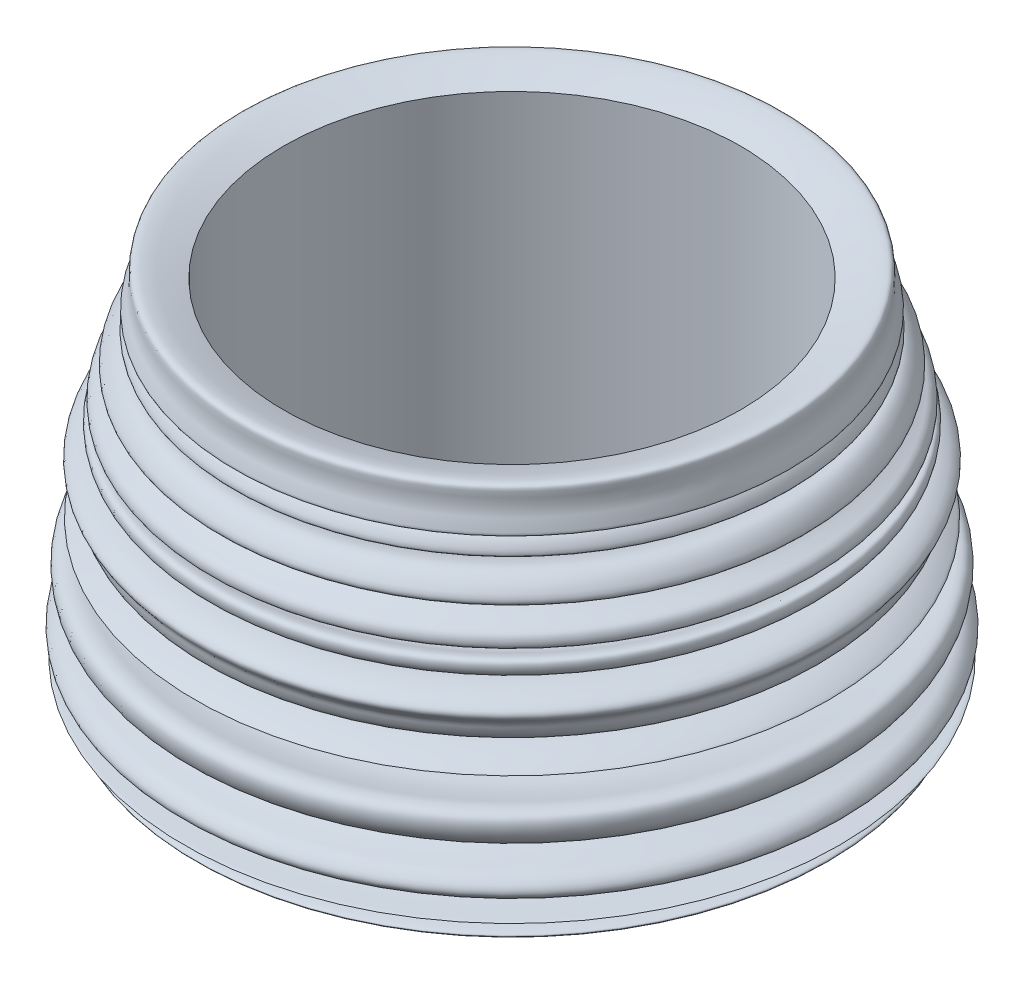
ISO-10303-21;
HEADER;
FILE_DESCRIPTION(('STEP AP214'),'2;1');
FILE_NAME('part.step','',(''),(''),'','','');
FILE_SCHEMA(('AUTOMOTIVE_DESIGN { 1 0 10303 214 1 1 1 1 }'));
ENDSEC;
DATA;
#1=APPLICATION_CONTEXT('core data for automotive mechanical design processes');
#2=APPLICATION_PROTOCOL_DEFINITION('international standard','automotive_design',2000,#1);
#3=PRODUCT_CONTEXT('',#1,'mechanical');
#4=PRODUCT('Part','Part','',(#3));
#5=PRODUCT_RELATED_PRODUCT_CATEGORY('part','',(#4));
#6=PRODUCT_DEFINITION_FORMATION('','',#4);
#7=PRODUCT_DEFINITION_CONTEXT('part definition',#1,'design');
#8=PRODUCT_DEFINITION('design','',#6,#7);
#9=PRODUCT_DEFINITION_SHAPE('','',#8);
#10=(LENGTH_UNIT() NAMED_UNIT(*) SI_UNIT(.MILLI.,.METRE.));
#11=(NAMED_UNIT(*) PLANE_ANGLE_UNIT() SI_UNIT($,.RADIAN.));
#12=(NAMED_UNIT(*) SI_UNIT($,.STERADIAN.) SOLID_ANGLE_UNIT());
#13=UNCERTAINTY_MEASURE_WITH_UNIT(LENGTH_MEASURE(1.E-05),#10,'distance_accuracy_value','');
#14=(GEOMETRIC_REPRESENTATION_CONTEXT(3) GLOBAL_UNCERTAINTY_ASSIGNED_CONTEXT((#13)) GLOBAL_UNIT_ASSIGNED_CONTEXT((#10,
#11,#12)) REPRESENTATION_CONTEXT('',''));
#15=CARTESIAN_POINT('',(0.,0.,0.));
#16=DIRECTION('',(0.,0.,1.));
#17=DIRECTION('',(1.,0.,0.));
#18=AXIS2_PLACEMENT_3D('',#15,#16,#17);
#19=CARTESIAN_POINT('',(254.,-203.2,0.));
#20=CARTESIAN_POINT('',(265.952529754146,-204.882481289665,0.));
#21=CARTESIAN_POINT('',(286.664606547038,-186.560116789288,0.));
#22=CARTESIAN_POINT('',(314.196289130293,-198.948779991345,0.));
#23=CARTESIAN_POINT('',(375.371053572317,-177.420666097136,0.));
#24=CARTESIAN_POINT('',(292.862010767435,-179.289172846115,0.));
#25=CARTESIAN_POINT('',(395.026881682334,-155.575786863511,0.));
#26=CARTESIAN_POINT('',(330.12286532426,-162.501229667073,0.));
#27=CARTESIAN_POINT('',(303.825414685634,-146.242672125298,0.));
#28=CARTESIAN_POINT('',(254.298366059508,-201.355487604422,0.));
#29=CARTESIAN_POINT('',(283.168759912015,-138.834023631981,0.));
#30=CARTESIAN_POINT('',(318.663391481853,-125.09657352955,0.));
#31=CARTESIAN_POINT('',(344.801872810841,-150.254129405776,0.));
#32=CARTESIAN_POINT('',(371.552736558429,-132.21928150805,0.));
#33=CARTESIAN_POINT('',(357.331031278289,-116.852774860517,0.));
#34=CARTESIAN_POINT('',(335.183473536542,-116.626494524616,0.));
#35=CARTESIAN_POINT('',(314.76371224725,-104.114267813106,0.));
#36=CARTESIAN_POINT('',(290.930141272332,-105.867373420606,0.));
#37=CARTESIAN_POINT('',(265.138896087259,-84.6601366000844,0.));
#38=CARTESIAN_POINT('',(296.700396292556,-79.2419504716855,0.));
#39=CARTESIAN_POINT('',(315.056688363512,-84.3141200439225,0.));
#40=CARTESIAN_POINT('',(333.018862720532,-85.1391881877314,0.));
#41=CARTESIAN_POINT('',(353.168796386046,-96.6513522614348,0.));
#42=CARTESIAN_POINT('',(364.360359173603,-77.9605645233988,0.));
#43=CARTESIAN_POINT('',(359.937371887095,-54.0381315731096,0.));
#44=CARTESIAN_POINT('',(334.350198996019,-62.0993563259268,0.));
#45=CARTESIAN_POINT('',(308.408866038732,-65.5578838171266,0.));
#46=CARTESIAN_POINT('',(266.921298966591,-65.152725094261,0.));
#47=CARTESIAN_POINT('',(278.116361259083,-25.289691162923,0.));
#48=CARTESIAN_POINT('',(300.203835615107,-30.0914391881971,0.));
#49=CARTESIAN_POINT('',(319.013552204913,-27.112533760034,0.));
#50=CARTESIAN_POINT('',(323.597307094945,-42.6009982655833,0.));
#51=CARTESIAN_POINT('',(345.705780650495,-34.7645053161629,0.));
#52=CARTESIAN_POINT('',(323.942552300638,-18.5220381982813,0.));
#53=CARTESIAN_POINT('',(371.866688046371,-35.6175920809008,0.));
#54=CARTESIAN_POINT('',(310.700893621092,-4.70586404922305,0.));
#55=CARTESIAN_POINT('',(293.182882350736,-25.2178642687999,0.));
#56=CARTESIAN_POINT('',(263.65787070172,-11.8919799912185,0.));
#57=CARTESIAN_POINT('',(272.759148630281,8.94482974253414,0.));
#58=CARTESIAN_POINT('',(286.787394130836,-5.3234872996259,0.));
#59=CARTESIAN_POINT('',(304.508520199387,-2.0808679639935,0.));
#60=CARTESIAN_POINT('',(321.599752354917,8.0992976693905,0.));
#61=CARTESIAN_POINT('',(338.504374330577,-5.47746777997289,0.));
#62=CARTESIAN_POINT('',(344.332027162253,9.37396273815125,0.));
#63=CARTESIAN_POINT('',(344.464675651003,19.2276328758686,0.));
#64=CARTESIAN_POINT('',(371.02466060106,41.4546052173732,0.));
#65=CARTESIAN_POINT('',(283.406826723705,53.9142230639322,0.));
#66=CARTESIAN_POINT('',(288.090688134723,13.3639981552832,0.));
#67=CARTESIAN_POINT('',(257.5613643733,28.4503665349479,0.));
#68=CARTESIAN_POINT('',(272.988727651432,49.2485078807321,0.));
#69=CARTESIAN_POINT('',(294.842139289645,57.6942232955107,0.));
#70=CARTESIAN_POINT('',(315.591317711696,51.4499757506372,0.));
#71=CARTESIAN_POINT('',(337.347308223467,55.5345952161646,0.));
#72=CARTESIAN_POINT('',(337.440008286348,76.2220269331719,0.));
#73=CARTESIAN_POINT('',(311.620096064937,64.270468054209,0.));
#74=CARTESIAN_POINT('',(294.468290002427,71.3067175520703,0.));
#75=CARTESIAN_POINT('',(258.569658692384,53.1430547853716,0.));
#76=CARTESIAN_POINT('',(272.119513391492,85.9415518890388,0.));
#77=CARTESIAN_POINT('',(293.905168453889,84.6174731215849,0.));
#78=CARTESIAN_POINT('',(311.847531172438,83.8549155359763,0.));
#79=CARTESIAN_POINT('',(336.543673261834,76.1888915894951,0.));
#80=CARTESIAN_POINT('',(332.609875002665,97.648509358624,0.));
#81=CARTESIAN_POINT('',(315.390923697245,98.4594451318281,0.));
#82=CARTESIAN_POINT('',(301.457676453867,112.374885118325,0.));
#83=CARTESIAN_POINT('',(281.985278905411,109.240948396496,0.));
#84=CARTESIAN_POINT('',(266.402647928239,85.0141285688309,0.));
#85=CARTESIAN_POINT('',(266.857617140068,121.655788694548,0.));
#86=CARTESIAN_POINT('',(287.740186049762,118.600653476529,0.));
#87=CARTESIAN_POINT('',(303.682688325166,122.96918095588,0.));
#88=CARTESIAN_POINT('',(312.888564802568,111.801079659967,0.));
#89=CARTESIAN_POINT('',(328.451726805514,117.979912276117,0.));
#90=CARTESIAN_POINT('',(317.541079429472,133.78753263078,0.));
#91=CARTESIAN_POINT('',(299.794900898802,146.452207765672,0.));
#92=CARTESIAN_POINT('',(263.029415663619,125.339461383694,0.));
#93=CARTESIAN_POINT('',(266.169354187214,155.511947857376,0.));
#94=CARTESIAN_POINT('',(286.086476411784,155.871857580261,0.));
#95=CARTESIAN_POINT('',(312.781305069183,147.577906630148,0.));
#96=CARTESIAN_POINT('',(299.634134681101,175.105388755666,0.));
#97=CARTESIAN_POINT('',(280.969532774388,172.842765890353,0.));
#98=CARTESIAN_POINT('',(252.556573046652,208.19344865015,0.));
#99=CARTESIAN_POINT('',(319.58357591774,154.571841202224,0.));
#100=CARTESIAN_POINT('',(289.113686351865,209.782839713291,0.));
#101=CARTESIAN_POINT('',(317.868052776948,226.535574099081,0.));
#102=CARTESIAN_POINT('',(254.,203.2,0.));
#103=B_SPLINE_CURVE_WITH_KNOTS('',3,(#19,#20,#21,#22,#23,#24,#25,#26,#27,#28,#29,#30,#31,#32,
#33,#34,#35,#36,#37,#38,#39,#40,#41,#42,#43,#44,#45,#46,#47,#48,#49,#50,#51,#52,#53,#54,#55,#56,
#57,#58,#59,#60,#61,#62,#63,#64,#65,#66,#67,#68,#69,#70,#71,#72,#73,#74,#75,#76,#77,#78,#79,#80,
#81,#82,#83,#84,#85,#86,#87,#88,#89,#90,#91,#92,#93,#94,#95,#96,#97,#98,#99,#100,#101,#102),
.UNSPECIFIED.,.F.,.F.,(4,1,1,1,1,1,1,1,1,1,1,1,1,1,1,1,1,1,1,1,1,1,1,1,1,1,1,1,1,1,1,1,1,1,1,1,
1,1,1,1,1,1,1,1,1,1,1,1,1,1,1,1,1,1,1,1,1,1,1,1,1,1,1,1,1,1,1,1,1,1,1,1,1,1,1,1,1,1,1,1,1,4),
(0.,0.0205009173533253,0.0340249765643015,0.0554400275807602,0.0707353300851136,
0.0947901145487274,0.114249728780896,0.124880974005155,0.150563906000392,0.173100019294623,
0.187899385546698,0.21185747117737,0.219446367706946,0.228676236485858,0.235917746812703,
0.256752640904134,0.264033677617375,0.277220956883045,0.289758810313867,0.297494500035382,
0.311311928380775,0.319299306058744,0.33056579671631,0.337807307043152,0.354113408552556,
0.360954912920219,0.385969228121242,0.396681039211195,0.411193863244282,0.417876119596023,
0.424402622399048,0.432118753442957,0.438092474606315,0.447807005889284,0.467003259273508,
0.483846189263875,0.496773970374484,0.503001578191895,0.508772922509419,0.521694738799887,
0.530605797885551,0.539814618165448,0.546260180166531,0.550665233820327,0.556639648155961,
0.592136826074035,0.597248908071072,0.609324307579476,0.619395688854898,0.63014172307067,
0.64750675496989,0.655191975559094,0.661345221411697,0.671016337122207,0.686708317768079,
0.70019839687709,0.710383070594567,0.723582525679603,0.732245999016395,0.744556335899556,
0.749867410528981,0.759087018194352,0.769041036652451,0.780474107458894,0.788818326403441,
0.799977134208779,0.81089477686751,0.817807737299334,0.825930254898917,0.830616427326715,
0.838900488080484,0.848135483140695,0.869065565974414,0.874637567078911,0.886951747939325,
0.897724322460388,0.904351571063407,0.922713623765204,0.930355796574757,0.955673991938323,
0.965015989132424,1.),.UNSPECIFIED.);
#104=CARTESIAN_POINT('',(0.,0.,0.));
#105=DIRECTION('',(0.,-1.,0.));
#106=AXIS1_PLACEMENT('',#104,#105);
#107=SURFACE_OF_REVOLUTION('',#103,#106);
#108=CARTESIAN_POINT('',(0.,203.2,0.));
#109=DIRECTION('',(0.,-1.,0.));
#110=DIRECTION('',(0.,0.,-1.));
#111=AXIS2_PLACEMENT_3D('',#108,#109,#110);
#112=CIRCLE('',#111,254.);
#113=CARTESIAN_POINT('',(0.,203.2,-254.));
#114=VERTEX_POINT('',#113);
#115=EDGE_CURVE('E10',#114,#114,#112,.T.);
#116=ORIENTED_EDGE('',*,*,#115,.T.);
#117=EDGE_LOOP('',(#116));
#118=FACE_BOUND('',#117,.T.);
#119=CARTESIAN_POINT('',(0.,-203.2,0.));
#120=DIRECTION('',(0.,-1.,0.));
#121=DIRECTION('',(0.,0.,-1.));
#122=AXIS2_PLACEMENT_3D('',#119,#120,#121);
#123=CIRCLE('',#122,254.);
#124=CARTESIAN_POINT('',(0.,-203.2,-254.));
#125=VERTEX_POINT('',#124);
#126=EDGE_CURVE('E38',#125,#125,#123,.T.);
#127=ORIENTED_EDGE('',*,*,#126,.F.);
#128=EDGE_LOOP('',(#127));
#129=FACE_BOUND('',#128,.T.);
#130=ADVANCED_FACE('F31',(#118,#129),#107,.F.);
#131=CARTESIAN_POINT('',(0.,0.,0.));
#132=DIRECTION('',(0.,-1.,0.));
#133=DIRECTION('',(0.,0.,-1.));
#134=AXIS2_PLACEMENT_3D('',#131,#132,#133);
#135=CYLINDRICAL_SURFACE('',#134,254.);
#136=ORIENTED_EDGE('',*,*,#126,.T.);
#137=EDGE_LOOP('',(#136));
#138=FACE_BOUND('',#137,.T.);
#139=ORIENTED_EDGE('',*,*,#115,.F.);
#140=EDGE_LOOP('',(#139));
#141=FACE_BOUND('',#140,.T.);
#142=ADVANCED_FACE('F50',(#138,#141),#135,.F.);
#143=CLOSED_SHELL('',(#130,#142));
#144=MANIFOLD_SOLID_BREP('B2',#143);
#145=ADVANCED_BREP_SHAPE_REPRESENTATION('',(#18,#144),#14);
#146=SHAPE_DEFINITION_REPRESENTATION(#9,#145);
ENDSEC;
END-ISO-10303-21;
